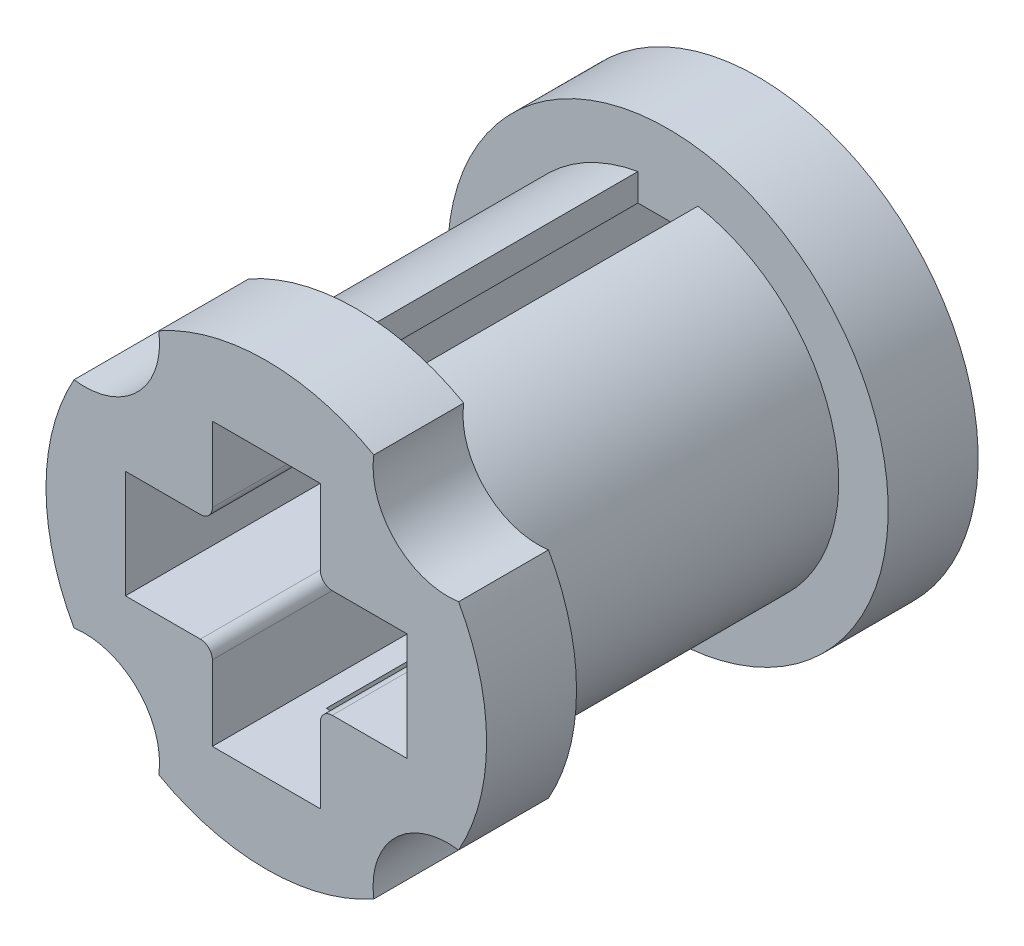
from build123d import *

# Parameters (mm, degrees)
SKETCH_1_R               = 2.85
EXTRUDE_752_DEPTH        = 5.2
SKETCH_2_R               = 3.675
EXTRUDE_1_DEPTH          = 1.5
EXTRUDE_START            = 1.5
SKETCH_3_R               = 3.675
EXTRUDE_2_DEPTH          = 1.5
CUT_EXTRUDE_1_DEPTH      = 9
SKETCH_5_R               = 1.25
CUT_EXTRUDE_2_DEPTH      = 1.5
PATTERN_CIRCULAR_1_COUNT = 4
SKETCH_7_W               = 1
SKETCH_7_H               = 5.2
CUT_EXTRUDE_3_DEPTH      = 6.75
FILLET2_R                = 0.2


with BuildPart() as part:
    # Sketch 1 → Extrude 752 (new body)
    with BuildSketch(Plane.XY):
        Circle(SKETCH_1_R)
    extrude(amount=-EXTRUDE_752_DEPTH)

    # Sketch 2 → Extrude 1 (add)
    with BuildSketch(Plane.XY):
        Circle(SKETCH_2_R)
    extrude(amount=EXTRUDE_1_DEPTH)

    # Sketch 3 → Extrude 2 (add)
    with BuildSketch(Plane(origin=(0, 0, -5.2), x_dir=(-1, 0, 0), z_dir=(0, 0, -1)).offset(EXTRUDE_START)):
        with Locations(Location((0, 0, 0), (0, 0, 180))):
            Circle(SKETCH_3_R)
    extrude(amount=-EXTRUDE_2_DEPTH)

    # Sketch 4 → Cut-Extrude 1 (cut)
    with BuildSketch(Plane.XY.offset(1.5)):
        Polygon((-0.9, 2.35), (0.9, 2.35), (0.9, 0.9), (2.35, 0.9), (2.35, -0.9), (0.9, -0.9), (0.9, -2.35), (-0.9, -2.35), (-0.9, -0.9), (-2.35, -0.9), (-2.35, 0.9), (-0.9, 0.9), align=None)
    extrude(amount=-CUT_EXTRUDE_1_DEPTH, mode=Mode.SUBTRACT)

    # Sketch 5 → Cut-Extrude 2 (cut)
    with BuildSketch(Plane.XY.offset(1.5)):
        with Locations((3.030764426, 3.030764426)):
            Circle(SKETCH_5_R)
    cut_extrude_2 = extrude(amount=-CUT_EXTRUDE_2_DEPTH, mode=Mode.SUBTRACT)

    # Pattern Circular 1: Cut-Extrude 2 ×4 about axis
    pattern_circular_1_axis = Axis((0, 0, 0), (0, 0, 1))
    for i in range(1, PATTERN_CIRCULAR_1_COUNT):
        add(cut_extrude_2.rotate(pattern_circular_1_axis, i * 360 / PATTERN_CIRCULAR_1_COUNT), mode=Mode.SUBTRACT)

    # Sketch 7 → Cut-Extrude 3 (cut, symmetric)
    with BuildSketch(Plane(origin=(0, 0, 0), x_dir=(1, 0, 0), z_dir=(0, 1, 0))):
        with Locations((0, 2.6)):
            Rectangle(SKETCH_7_W, SKETCH_7_H)
    extrude(amount=CUT_EXTRUDE_3_DEPTH, both=True, mode=Mode.SUBTRACT)

    # Fillet2
    fillet2_edges = [part.edges().sort_by_distance(p)[0] for p in [
        (-0.9, 0.9, -2.6),
        (0.9, 0.9, -2.6),
        (0.9, -0.9, -2.6),
        (-0.9, -0.9, -2.6),
    ]]
    fillet(fillet2_edges, radius=FILLET2_R)


solid = part.part
